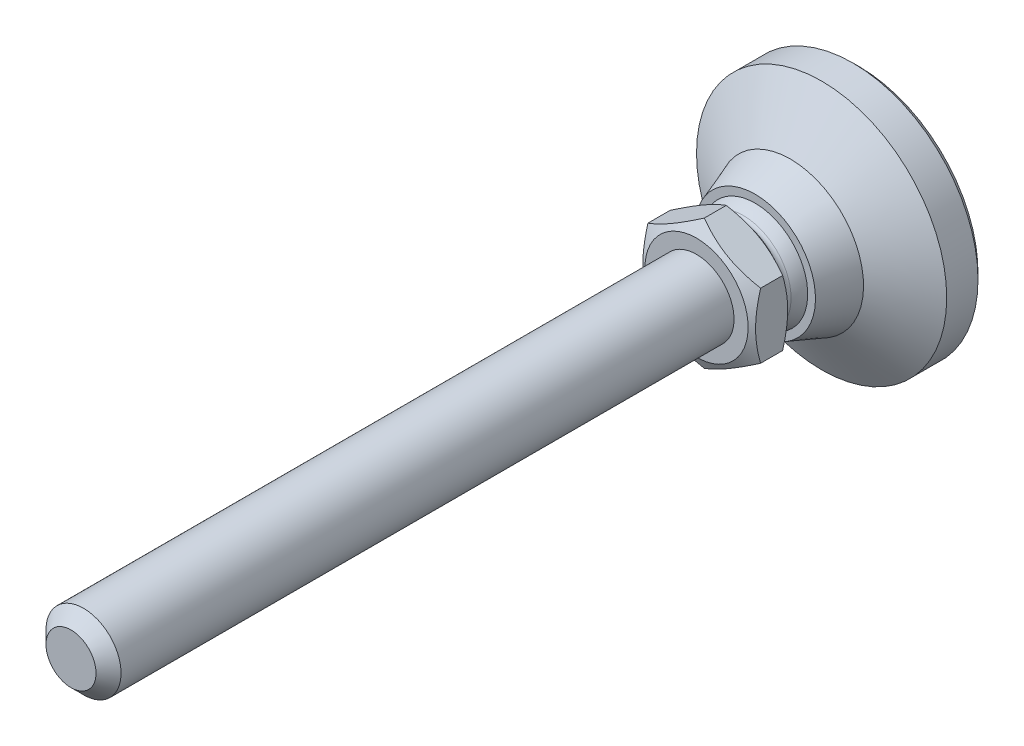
ISO-10303-21;
HEADER;
FILE_DESCRIPTION(('STEP AP214'),'2;1');
FILE_NAME('part.step','',(''),(''),'','','');
FILE_SCHEMA(('AUTOMOTIVE_DESIGN { 1 0 10303 214 1 1 1 1 }'));
ENDSEC;
DATA;
#1=APPLICATION_CONTEXT('core data for automotive mechanical design processes');
#2=APPLICATION_PROTOCOL_DEFINITION('international standard','automotive_design',2000,#1);
#3=PRODUCT_CONTEXT('',#1,'mechanical');
#4=PRODUCT('Part','Part','',(#3));
#5=PRODUCT_RELATED_PRODUCT_CATEGORY('part','',(#4));
#6=PRODUCT_DEFINITION_FORMATION('','',#4);
#7=PRODUCT_DEFINITION_CONTEXT('part definition',#1,'design');
#8=PRODUCT_DEFINITION('design','',#6,#7);
#9=PRODUCT_DEFINITION_SHAPE('','',#8);
#10=(LENGTH_UNIT() NAMED_UNIT(*) SI_UNIT(.MILLI.,.METRE.));
#11=(NAMED_UNIT(*) PLANE_ANGLE_UNIT() SI_UNIT($,.RADIAN.));
#12=(NAMED_UNIT(*) SI_UNIT($,.STERADIAN.) SOLID_ANGLE_UNIT());
#13=UNCERTAINTY_MEASURE_WITH_UNIT(LENGTH_MEASURE(1.E-05),#10,'distance_accuracy_value','');
#14=(GEOMETRIC_REPRESENTATION_CONTEXT(3) GLOBAL_UNCERTAINTY_ASSIGNED_CONTEXT((#13)) GLOBAL_UNIT_ASSIGNED_CONTEXT((#10,
#11,#12)) REPRESENTATION_CONTEXT('',''));
#15=CARTESIAN_POINT('',(0.,0.,0.));
#16=DIRECTION('',(0.,0.,1.));
#17=DIRECTION('',(1.,0.,0.));
#18=AXIS2_PLACEMENT_3D('',#15,#16,#17);
#19=CARTESIAN_POINT('',(0.,0.,19.0000000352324));
#20=DIRECTION('',(0.,0.,-1.));
#21=DIRECTION('',(0.,1.,0.));
#22=AXIS2_PLACEMENT_3D('',#19,#20,#21);
#23=TOROIDAL_SURFACE('',#22,8.5000000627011,1.);
#24=CARTESIAN_POINT('',(0.,0.,18.5101289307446));
#25=DIRECTION('',(0.,0.,-1.));
#26=DIRECTION('',(0.,1.,0.));
#27=AXIS2_PLACEMENT_3D('',#24,#25,#26);
#28=CIRCLE('',#27,7.62820518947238);
#29=CARTESIAN_POINT('',(-7.62820518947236,0.,18.5101289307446));
#30=VERTEX_POINT('',#29);
#31=EDGE_CURVE('E73',#30,#30,#28,.T.);
#32=ORIENTED_EDGE('',*,*,#31,.F.);
#33=EDGE_LOOP('',(#32));
#34=FACE_BOUND('',#33,.T.);
#35=CARTESIAN_POINT('',(0.,0.,20.0000000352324));
#36=DIRECTION('',(0.,0.,-1.));
#37=DIRECTION('',(0.,1.,0.));
#38=AXIS2_PLACEMENT_3D('',#35,#36,#37);
#39=CIRCLE('',#38,8.5000000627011);
#40=CARTESIAN_POINT('',(0.,8.5000000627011,20.0000000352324));
#41=VERTEX_POINT('',#40);
#42=EDGE_CURVE('E78',#41,#41,#39,.F.);
#43=ORIENTED_EDGE('',*,*,#42,.F.);
#44=EDGE_LOOP('',(#43));
#45=FACE_BOUND('',#44,.T.);
#46=ADVANCED_FACE('F14',(#34,#45),#23,.F.);
#47=CARTESIAN_POINT('',(0.,0.,14.223757));
#48=DIRECTION('',(0.,0.,-1.));
#49=DIRECTION('',(-1.,0.,0.));
#50=AXIS2_PLACEMENT_3D('',#47,#48,#49);
#51=SPHERICAL_SURFACE('',#50,8.74999992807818);
#52=CARTESIAN_POINT('',(0.,0.,16.635983));
#53=DIRECTION('',(0.,0.,-1.));
#54=DIRECTION('',(0.,1.,0.));
#55=AXIS2_PLACEMENT_3D('',#52,#53,#54);
#56=CIRCLE('',#55,8.41092530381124);
#57=CARTESIAN_POINT('',(-8.41092530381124,0.,16.635983));
#58=VERTEX_POINT('',#57);
#59=EDGE_CURVE('E109',#58,#58,#56,.T.);
#60=CARTESIAN_POINT('',(-8.41092530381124,0.,16.635983));
#61=CARTESIAN_POINT('',(-8.4050796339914,0.,16.6563656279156));
#62=CARTESIAN_POINT('',(-8.39915987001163,0.,16.6767270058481));
#63=CARTESIAN_POINT('',(-8.38717247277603,0.,16.7174061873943));
#64=CARTESIAN_POINT('',(-8.38110483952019,0.,16.7377239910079));
#65=CARTESIAN_POINT('',(-8.36882202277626,0.,16.7783149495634));
#66=CARTESIAN_POINT('',(-8.36260683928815,0.,16.7985881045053));
#67=CARTESIAN_POINT('',(-8.35002925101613,0.,16.8390886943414));
#68=CARTESIAN_POINT('',(-8.34366684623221,0.,16.8593161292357));
#69=CARTESIAN_POINT('',(-8.33079515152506,0.,16.8997242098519));
#70=CARTESIAN_POINT('',(-8.32428586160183,0.,16.9199048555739));
#71=CARTESIAN_POINT('',(-8.31112074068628,0.,16.9602182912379));
#72=CARTESIAN_POINT('',(-8.30446490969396,0.,16.98035108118));
#73=CARTESIAN_POINT('',(-8.29100705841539,0.,17.0205677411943));
#74=CARTESIAN_POINT('',(-8.28420503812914,0.,17.0406516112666));
#75=CARTESIAN_POINT('',(-8.27045516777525,0.,17.08076937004));
#76=CARTESIAN_POINT('',(-8.26350731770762,0.,17.1008032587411));
#77=CARTESIAN_POINT('',(-8.24946615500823,0.,17.1408199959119));
#78=CARTESIAN_POINT('',(-8.24237284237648,0.,17.1608028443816));
#79=CARTESIAN_POINT('',(-8.22804112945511,0.,17.2007164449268));
#80=CARTESIAN_POINT('',(-8.22080272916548,0.,17.2206471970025));
#81=CARTESIAN_POINT('',(-8.20618122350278,0.,17.2604555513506));
#82=CARTESIAN_POINT('',(-8.1987981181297,0.,17.2803331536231));
#83=CARTESIAN_POINT('',(-8.18388759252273,0.,17.3200341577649));
#84=CARTESIAN_POINT('',(-8.17636017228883,0.,17.3398575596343));
#85=CARTESIAN_POINT('',(-8.16116141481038,0.,17.3794491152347));
#86=CARTESIAN_POINT('',(-8.15349007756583,0.,17.3992172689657));
#87=CARTESIAN_POINT('',(-8.13800389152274,0.,17.4386972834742));
#88=CARTESIAN_POINT('',(-8.13018904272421,0.,17.4584091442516));
#89=CARTESIAN_POINT('',(-8.11441624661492,0.,17.4977755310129));
#90=CARTESIAN_POINT('',(-8.10645829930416,0.,17.5174300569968));
#91=CARTESIAN_POINT('',(-8.09039972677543,0.,17.5566807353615));
#92=CARTESIAN_POINT('',(-8.08229910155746,0.,17.5762768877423));
#93=CARTESIAN_POINT('',(-8.06595560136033,0.,17.6154097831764));
#94=CARTESIAN_POINT('',(-8.05771272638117,0.,17.6349465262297));
#95=CARTESIAN_POINT('',(-8.04108516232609,0.,17.6739595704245));
#96=CARTESIAN_POINT('',(-8.03270047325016,0.,17.6934358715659));
#97=CARTESIAN_POINT('',(-8.01578972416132,0.,17.7323270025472));
#98=CARTESIAN_POINT('',(-8.00726366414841,0.,17.751741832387));
#99=CARTESIAN_POINT('',(-7.99007062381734,0.,17.7905089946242));
#100=CARTESIAN_POINT('',(-7.98140364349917,0.,17.8098613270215));
#101=CARTESIAN_POINT('',(-7.96392922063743,0.,17.8485024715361));
#102=CARTESIAN_POINT('',(-7.95512177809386,0.,17.8677912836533));
#103=CARTESIAN_POINT('',(-7.93736689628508,0.,17.9063043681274));
#104=CARTESIAN_POINT('',(-7.92841945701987,0.,17.9255286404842));
#105=CARTESIAN_POINT('',(-7.91038505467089,0.,17.9639116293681));
#106=CARTESIAN_POINT('',(-7.90129809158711,0.,17.9830703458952));
#107=CARTESIAN_POINT('',(-7.88298512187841,0.,18.0213212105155));
#108=CARTESIAN_POINT('',(-7.87375911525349,0.,18.0404133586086));
#109=CARTESIAN_POINT('',(-7.85516854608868,0.,18.0785300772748));
#110=CARTESIAN_POINT('',(-7.8458039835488,0.,18.0975546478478));
#111=CARTESIAN_POINT('',(-7.8269367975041,0.,18.1355352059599));
#112=CARTESIAN_POINT('',(-7.81743417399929,0.,18.1544911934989));
#113=CARTESIAN_POINT('',(-7.79829136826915,0.,18.1923335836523));
#114=CARTESIAN_POINT('',(-7.78865118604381,0.,18.2112199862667));
#115=CARTESIAN_POINT('',(-7.76923377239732,0.,18.2489222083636));
#116=CARTESIAN_POINT('',(-7.75945654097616,0.,18.267738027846));
#117=CARTESIAN_POINT('',(-7.73976554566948,0.,18.3052980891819));
#118=CARTESIAN_POINT('',(-7.72985178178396,0.,18.3240423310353));
#119=CARTESIAN_POINT('',(-7.70988824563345,0.,18.3614582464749));
#120=CARTESIAN_POINT('',(-7.69983847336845,0.,18.3801299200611));
#121=CARTESIAN_POINT('',(-7.67960345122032,0.,18.4173997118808));
#122=CARTESIAN_POINT('',(-7.66941820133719,0.,18.4359978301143));
#123=CARTESIAN_POINT('',(-7.64891276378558,0.,18.4731195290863));
#124=CARTESIAN_POINT('',(-7.63859257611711,0.,18.4916431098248));
#125=CARTESIAN_POINT('',(-7.62820518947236,0.,18.5101289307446));
#126=B_SPLINE_CURVE_WITH_KNOTS('',3,(#60,#61,#62,#63,#64,#65,#66,#67,#68,#69,#70,#71,#72,#73,
#74,#75,#76,#77,#78,#79,#80,#81,#82,#83,#84,#85,#86,#87,#88,#89,#90,#91,#92,#93,#94,#95,#96,#97,
#98,#99,#100,#101,#102,#103,#104,#105,#106,#107,#108,#109,#110,#111,#112,#113,#114,#115,#116,
#117,#118,#119,#120,#121,#122,#123,#124,#125),.UNSPECIFIED.,.F.,.F.,(4,2,2,2,2,2,2,2,2,2,2,2,2,
2,2,2,2,2,2,2,2,2,2,2,2,2,2,2,2,2,2,2,4),(0.,0.0636128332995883,0.127225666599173,
0.19083849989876,0.254451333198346,0.318064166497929,0.381676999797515,0.445289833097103,
0.508902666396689,0.572515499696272,0.63612833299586,0.699741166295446,0.763353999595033,
0.826966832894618,0.890579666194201,0.954192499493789,1.01780533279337,1.08141816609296,
1.14503099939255,1.20864383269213,1.27225666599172,1.3358694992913,1.39948233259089,
1.46309516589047,1.52670799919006,1.59032083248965,1.65393366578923,1.71754649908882,
1.78115933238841,1.84477216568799,1.90838499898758,1.97199783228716,2.03561066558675),.UNSPECIFIED.);
#127=EDGE_CURVE('BSEAM224',#58,#30,#126,.T.);
#128=ORIENTED_EDGE('',*,*,#59,.F.);
#129=ORIENTED_EDGE('',*,*,#31,.T.);
#130=ORIENTED_EDGE('',*,*,#127,.T.);
#131=ORIENTED_EDGE('',*,*,#127,.F.);
#132=EDGE_LOOP('',(#128,#130,#129,#131));
#133=FACE_BOUND('',#132,.T.);
#134=ADVANCED_FACE('F224',(#133),#51,.T.);
#135=CARTESIAN_POINT('',(-8.41092530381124,0.,16.635983));
#136=DIRECTION('',(0.,0.,-1.));
#137=DIRECTION('',(0.,1.,0.));
#138=AXIS2_PLACEMENT_3D('',#135,#136,#137);
#139=PLANE('',#138);
#140=CARTESIAN_POINT('',(0.,0.,16.635983));
#141=DIRECTION('',(0.,0.,-1.));
#142=DIRECTION('',(0.,1.,0.));
#143=AXIS2_PLACEMENT_3D('',#140,#141,#142);
#144=CIRCLE('',#143,9.649999);
#145=CARTESIAN_POINT('',(0.,9.649999,16.635983));
#146=VERTEX_POINT('',#145);
#147=EDGE_CURVE('E106',#146,#146,#144,.T.);
#148=ORIENTED_EDGE('',*,*,#147,.F.);
#149=EDGE_LOOP('',(#148));
#150=FACE_BOUND('',#149,.T.);
#151=ORIENTED_EDGE('',*,*,#59,.T.);
#152=EDGE_LOOP('',(#151));
#153=FACE_BOUND('',#152,.T.);
#154=ADVANCED_FACE('F220',(#150,#153),#139,.F.);
#155=CARTESIAN_POINT('',(0.,0.,16.635983));
#156=DIRECTION('',(0.,0.,-1.));
#157=DIRECTION('',(0.,1.,0.));
#158=AXIS2_PLACEMENT_3D('',#155,#156,#157);
#159=CONICAL_SURFACE('',#158,9.649999,0.349065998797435);
#160=CARTESIAN_POINT('',(0.,0.,11.));
#161=DIRECTION('',(0.,0.,-1.));
#162=DIRECTION('',(0.,1.,0.));
#163=AXIS2_PLACEMENT_3D('',#160,#161,#162);
#164=CIRCLE('',#163,11.70133);
#165=CARTESIAN_POINT('',(0.,11.70133,11.));
#166=VERTEX_POINT('',#165);
#167=EDGE_CURVE('E103',#166,#166,#164,.T.);
#168=ORIENTED_EDGE('',*,*,#167,.F.);
#169=EDGE_LOOP('',(#168));
#170=FACE_BOUND('',#169,.T.);
#171=ORIENTED_EDGE('',*,*,#147,.T.);
#172=EDGE_LOOP('',(#171));
#173=FACE_BOUND('',#172,.T.);
#174=ADVANCED_FACE('F216',(#170,#173),#159,.T.);
#175=CARTESIAN_POINT('',(0.,0.,11.));
#176=DIRECTION('',(0.,0.,-1.));
#177=DIRECTION('',(0.,1.,0.));
#178=AXIS2_PLACEMENT_3D('',#175,#176,#177);
#179=CONICAL_SURFACE('',#178,11.70133,1.02853608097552);
#180=CARTESIAN_POINT('',(0.,0.,6.));
#181=DIRECTION('',(0.,0.,-1.));
#182=DIRECTION('',(0.,1.,0.));
#183=AXIS2_PLACEMENT_3D('',#180,#181,#182);
#184=CIRCLE('',#183,20.);
#185=CARTESIAN_POINT('',(0.,20.,6.));
#186=VERTEX_POINT('',#185);
#187=EDGE_CURVE('E100',#186,#186,#184,.T.);
#188=ORIENTED_EDGE('',*,*,#187,.F.);
#189=EDGE_LOOP('',(#188));
#190=FACE_BOUND('',#189,.T.);
#191=ORIENTED_EDGE('',*,*,#167,.T.);
#192=EDGE_LOOP('',(#191));
#193=FACE_BOUND('',#192,.T.);
#194=ADVANCED_FACE('F212',(#190,#193),#179,.T.);
#195=CARTESIAN_POINT('',(0.,0.,0.));
#196=DIRECTION('',(0.,0.,-1.));
#197=DIRECTION('',(0.,1.,0.));
#198=AXIS2_PLACEMENT_3D('',#195,#196,#197);
#199=CYLINDRICAL_SURFACE('',#198,20.);
#200=CARTESIAN_POINT('',(0.,0.,1.));
#201=DIRECTION('',(0.,0.,-1.));
#202=DIRECTION('',(0.,1.,0.));
#203=AXIS2_PLACEMENT_3D('',#200,#201,#202);
#204=CIRCLE('',#203,20.);
#205=CARTESIAN_POINT('',(0.,20.,1.));
#206=VERTEX_POINT('',#205);
#207=EDGE_CURVE('E97',#206,#206,#204,.T.);
#208=ORIENTED_EDGE('',*,*,#207,.F.);
#209=EDGE_LOOP('',(#208));
#210=FACE_BOUND('',#209,.T.);
#211=ORIENTED_EDGE('',*,*,#187,.T.);
#212=EDGE_LOOP('',(#211));
#213=FACE_BOUND('',#212,.T.);
#214=ADVANCED_FACE('F208',(#210,#213),#199,.T.);
#215=CARTESIAN_POINT('',(0.,0.,1.));
#216=DIRECTION('',(0.,0.,1.));
#217=DIRECTION('',(0.,-1.,0.));
#218=AXIS2_PLACEMENT_3D('',#215,#216,#217);
#219=CONICAL_SURFACE('',#218,20.,0.785398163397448);
#220=CARTESIAN_POINT('',(0.,0.,0.));
#221=DIRECTION('',(0.,0.,-1.));
#222=DIRECTION('',(0.,1.,0.));
#223=AXIS2_PLACEMENT_3D('',#220,#221,#222);
#224=CIRCLE('',#223,19.);
#225=CARTESIAN_POINT('',(0.,19.,0.));
#226=VERTEX_POINT('',#225);
#227=EDGE_CURVE('E94',#226,#226,#224,.T.);
#228=ORIENTED_EDGE('',*,*,#227,.F.);
#229=EDGE_LOOP('',(#228));
#230=FACE_BOUND('',#229,.T.);
#231=ORIENTED_EDGE('',*,*,#207,.T.);
#232=EDGE_LOOP('',(#231));
#233=FACE_BOUND('',#232,.T.);
#234=ADVANCED_FACE('F204',(#230,#233),#219,.T.);
#235=CARTESIAN_POINT('',(0.,0.,0.));
#236=DIRECTION('',(0.,0.,1.));
#237=DIRECTION('',(0.,-1.,0.));
#238=AXIS2_PLACEMENT_3D('',#235,#236,#237);
#239=PLANE('',#238);
#240=ORIENTED_EDGE('',*,*,#227,.T.);
#241=EDGE_LOOP('',(#240));
#242=FACE_BOUND('',#241,.T.);
#243=ADVANCED_FACE('F200',(#242),#239,.F.);
#244=CARTESIAN_POINT('',(0.,8.25,20.0000000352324));
#245=DIRECTION('',(0.,0.,-1.));
#246=DIRECTION('',(0.,1.,0.));
#247=AXIS2_PLACEMENT_3D('',#244,#245,#246);
#248=PLANE('',#247);
#249=ORIENTED_EDGE('',*,*,#42,.T.);
#250=EDGE_LOOP('',(#249));
#251=FACE_BOUND('',#250,.T.);
#252=CARTESIAN_POINT('',(0.,0.,20.0000000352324));
#253=DIRECTION('',(0.,0.,-1.));
#254=DIRECTION('',(0.,1.,0.));
#255=AXIS2_PLACEMENT_3D('',#252,#253,#254);
#256=CIRCLE('',#255,8.25);
#257=CARTESIAN_POINT('',(0.,8.25,20.0000000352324));
#258=VERTEX_POINT('',#257);
#259=EDGE_CURVE('E292',#258,#258,#256,.T.);
#260=ORIENTED_EDGE('',*,*,#259,.T.);
#261=EDGE_LOOP('',(#260));
#262=FACE_BOUND('',#261,.T.);
#263=ADVANCED_FACE('F129',(#251,#262),#248,.F.);
#264=CARTESIAN_POINT('',(0.,0.,22.0431578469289));
#265=DIRECTION('',(0.,0.,1.));
#266=DIRECTION('',(0.,-1.,0.));
#267=AXIS2_PLACEMENT_3D('',#264,#265,#266);
#268=CONICAL_SURFACE('',#267,11.7888531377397,1.0471975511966);
#269=CARTESIAN_POINT('',(0.000200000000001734,-10.4000990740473,21.2413603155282));
#270=CARTESIAN_POINT('',(-0.19775320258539,-10.2858107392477,21.1753793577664));
#271=CARTESIAN_POINT('',(-0.396478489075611,-10.1710766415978,21.1123922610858));
#272=CARTESIAN_POINT('',(-0.795542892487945,-9.94067670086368,20.9932318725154));
#273=CARTESIAN_POINT('',(-0.995882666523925,-9.82501047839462,20.9370615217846));
#274=CARTESIAN_POINT('',(-1.39854780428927,-9.59253165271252,20.8322960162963));
#275=CARTESIAN_POINT('',(-1.60087672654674,-9.47571699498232,20.7837189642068));
#276=CARTESIAN_POINT('',(-2.00691067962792,-9.24129318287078,20.6951913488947));
#277=CARTESIAN_POINT('',(-2.21061542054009,-9.12368419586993,20.655239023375));
#278=CARTESIAN_POINT('',(-2.61423624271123,-8.89065360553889,20.5856466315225));
#279=CARTESIAN_POINT('',(-2.81412251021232,-8.77524921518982,20.5557774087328));
#280=CARTESIAN_POINT('',(-3.21478942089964,-8.54392406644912,20.5056962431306));
#281=CARTESIAN_POINT('',(-3.41556998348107,-8.42800335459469,20.4854834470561));
#282=CARTESIAN_POINT('',(-3.81747936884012,-8.19596086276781,20.4552200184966));
#283=CARTESIAN_POINT('',(-4.01860753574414,-8.07983946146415,20.4451578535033));
#284=CARTESIAN_POINT('',(-4.4210489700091,-7.84748979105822,20.4354133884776));
#285=CARTESIAN_POINT('',(-4.62236223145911,-7.73126152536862,20.4357307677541));
#286=CARTESIAN_POINT('',(-4.99872349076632,-7.51396925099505,20.4460228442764));
#287=CARTESIAN_POINT('',(-5.17379802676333,-7.41288992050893,20.4547420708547));
#288=CARTESIAN_POINT('',(-5.52353701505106,-7.2109680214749,20.4798612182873));
#289=CARTESIAN_POINT('',(-5.69820143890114,-7.1101254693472,20.4962616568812));
#290=CARTESIAN_POINT('',(-6.2215185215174,-6.80798821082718,20.5565970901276));
#291=CARTESIAN_POINT('',(-6.56924487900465,-6.60722830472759,20.6116586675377));
#292=CARTESIAN_POINT('',(-7.26838615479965,-6.20357890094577,20.7493132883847));
#293=CARTESIAN_POINT('',(-7.61971184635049,-6.00074091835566,20.8324898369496));
#294=CARTESIAN_POINT('',(-8.31712409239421,-5.59808977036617,21.0212661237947));
#295=CARTESIAN_POINT('',(-8.66321957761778,-5.39827144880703,21.1268215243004));
#296=CARTESIAN_POINT('',(-9.00685,-5.19987633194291,21.2413603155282));
#297=B_SPLINE_CURVE_WITH_KNOTS('',3,(#269,#270,#271,#272,#273,#274,#275,#276,#277,#278,#279,
#280,#281,#282,#283,#284,#285,#286,#287,#288,#289,#290,#291,#292,#293,#294,#295,#296),
.UNSPECIFIED.,.F.,.F.,(4,2,2,2,2,2,2,2,2,2,2,2,2,4),(0.,0.713746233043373,1.42779933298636,
2.14352961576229,2.85911351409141,3.55712384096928,4.25507247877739,4.95222725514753,
5.64936049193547,6.25624894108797,6.86317830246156,8.07790154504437,9.31956468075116,
10.5587904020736),.UNSPECIFIED.);
#298=CARTESIAN_POINT('',(0.,-10.3999836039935,21.2412936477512));
#299=VERTEX_POINT('',#298);
#300=CARTESIAN_POINT('',(-9.00665,-5.19999180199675,21.2412936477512));
#301=VERTEX_POINT('',#300);
#302=EDGE_CURVE('E69',#299,#301,#297,.T.);
#303=ORIENTED_EDGE('',*,*,#302,.T.);
#304=CARTESIAN_POINT('',(-9.00665,13.8418368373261,24.7712924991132));
#305=CARTESIAN_POINT('',(-9.00665,13.645666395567,24.676362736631));
#306=CARTESIAN_POINT('',(-9.00665,13.449262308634,24.581916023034));
#307=CARTESIAN_POINT('',(-9.00665,13.0559380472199,24.3940983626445));
#308=CARTESIAN_POINT('',(-9.00665,12.8590178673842,24.3007274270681));
#309=CARTESIAN_POINT('',(-9.00665,12.2673557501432,24.0223673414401));
#310=CARTESIAN_POINT('',(-9.00665,11.8717722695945,23.8391600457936));
#311=CARTESIAN_POINT('',(-9.00665,11.075701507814,23.4776158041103));
#312=CARTESIAN_POINT('',(-9.00665,10.6751991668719,23.2993119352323));
#313=CARTESIAN_POINT('',(-9.00665,9.87096507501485,22.9501690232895));
#314=CARTESIAN_POINT('',(-9.00665,9.46723348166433,22.7793296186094));
#315=CARTESIAN_POINT('',(-9.00665,8.64339130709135,22.4419741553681));
#316=CARTESIAN_POINT('',(-9.00665,8.22315919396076,22.2757532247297));
#317=CARTESIAN_POINT('',(-9.00665,7.37773338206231,21.9561991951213));
#318=CARTESIAN_POINT('',(-9.00665,6.95253912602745,21.8028675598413));
#319=CARTESIAN_POINT('',(-9.00665,6.09734470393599,21.5132106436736));
#320=CARTESIAN_POINT('',(-9.00665,5.66735670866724,21.3768498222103));
#321=CARTESIAN_POINT('',(-9.00665,4.80123080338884,21.1255906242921));
#322=CARTESIAN_POINT('',(-9.00665,4.36509491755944,21.0106853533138));
#323=CARTESIAN_POINT('',(-9.00665,3.4887324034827,20.8085420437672));
#324=CARTESIAN_POINT('',(-9.00665,3.04853998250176,20.7211597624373));
#325=CARTESIAN_POINT('',(-9.00665,2.38434575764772,20.614577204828));
#326=CARTESIAN_POINT('',(-9.00665,2.16227951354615,20.5831300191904));
#327=CARTESIAN_POINT('',(-9.00665,1.71708662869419,20.5290187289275));
#328=CARTESIAN_POINT('',(-9.00665,1.49396009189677,20.5063537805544));
#329=CARTESIAN_POINT('',(-9.00665,1.04980509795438,20.4705363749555));
#330=CARTESIAN_POINT('',(-9.00665,0.828786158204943,20.4572663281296));
#331=CARTESIAN_POINT('',(-9.00665,0.386385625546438,20.4400752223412));
#332=CARTESIAN_POINT('',(-9.00665,0.165004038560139,20.436154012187));
#333=CARTESIAN_POINT('',(-9.00665,-0.277728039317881,20.4377538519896));
#334=CARTESIAN_POINT('',(-9.00665,-0.499078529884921,20.4432749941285));
#335=CARTESIAN_POINT('',(-9.00665,-0.941354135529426,20.463627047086));
#336=CARTESIAN_POINT('',(-9.00665,-1.16227922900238,20.4784584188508));
#337=CARTESIAN_POINT('',(-9.00665,-1.69708677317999,20.5253211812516));
#338=CARTESIAN_POINT('',(-9.00665,-2.01057025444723,20.5619837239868));
#339=CARTESIAN_POINT('',(-9.00665,-2.63512878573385,20.6520270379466));
#340=CARTESIAN_POINT('',(-9.00665,-2.94620348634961,20.7054101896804));
#341=CARTESIAN_POINT('',(-9.00665,-3.56567550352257,20.8269954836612));
#342=CARTESIAN_POINT('',(-9.00665,-3.87407046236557,20.8952095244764));
#343=CARTESIAN_POINT('',(-9.00665,-4.48772745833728,21.0443828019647));
#344=CARTESIAN_POINT('',(-9.00665,-4.79298955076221,21.1253418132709));
#345=CARTESIAN_POINT('',(-9.00665,-5.40705625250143,21.2999460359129));
#346=CARTESIAN_POINT('',(-9.00665,-5.71579258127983,21.3938297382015));
#347=CARTESIAN_POINT('',(-9.00665,-6.33022259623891,21.5910253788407));
#348=CARTESIAN_POINT('',(-9.00665,-6.63591626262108,21.6943373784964));
#349=CARTESIAN_POINT('',(-9.00665,-7.24441712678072,21.9087730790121));
#350=CARTESIAN_POINT('',(-9.00665,-7.54722530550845,22.0198940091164));
#351=CARTESIAN_POINT('',(-9.00665,-8.15035041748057,22.2486669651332));
#352=CARTESIAN_POINT('',(-9.00665,-8.4506673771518,22.3663189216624));
#353=CARTESIAN_POINT('',(-9.00665,-9.14814564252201,22.6469122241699));
#354=CARTESIAN_POINT('',(-9.00665,-9.544460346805,22.8119545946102));
#355=CARTESIAN_POINT('',(-9.00665,-10.3338341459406,23.1496706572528));
#356=CARTESIAN_POINT('',(-9.00665,-10.7268930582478,23.3223447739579));
#357=CARTESIAN_POINT('',(-9.00665,-11.5103487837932,23.6738242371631));
#358=CARTESIAN_POINT('',(-9.00665,-11.9007450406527,23.8526308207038));
#359=CARTESIAN_POINT('',(-9.00665,-12.6792321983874,24.2151632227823));
#360=CARTESIAN_POINT('',(-9.00665,-13.0673231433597,24.3988889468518));
#361=CARTESIAN_POINT('',(-9.00665,-13.8419692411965,24.7705441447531));
#362=CARTESIAN_POINT('',(-9.00665,-14.2285224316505,24.9584777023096));
#363=CARTESIAN_POINT('',(-9.00665,-14.9999978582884,25.3376660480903));
#364=CARTESIAN_POINT('',(-9.00665,-15.3849200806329,25.5289208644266));
#365=CARTESIAN_POINT('',(-9.00665,-16.5375296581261,26.1067529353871));
#366=CARTESIAN_POINT('',(-9.00665,-17.3031546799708,26.4974436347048));
#367=CARTESIAN_POINT('',(-9.00665,-18.7683412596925,27.2545281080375));
#368=CARTESIAN_POINT('',(-9.00665,-19.4682166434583,27.6203171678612));
#369=CARTESIAN_POINT('',(-9.00665,-20.8653801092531,28.3568542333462));
#370=CARTESIAN_POINT('',(-9.00665,-21.5626681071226,28.7276023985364));
#371=CARTESIAN_POINT('',(-9.00665,-22.9535940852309,29.4720181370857));
#372=CARTESIAN_POINT('',(-9.00665,-23.6472367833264,29.8456769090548));
#373=CARTESIAN_POINT('',(-9.00665,-25.0328619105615,30.5959765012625));
#374=CARTESIAN_POINT('',(-9.00665,-25.7248444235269,30.9726171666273));
#375=CARTESIAN_POINT('',(-9.00665,-26.4162126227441,31.3503746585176));
#376=B_SPLINE_CURVE_WITH_KNOTS('',3,(#304,#305,#306,#307,#308,#309,#310,#311,#312,#313,#314,
#315,#316,#317,#318,#319,#320,#321,#322,#323,#324,#325,#326,#327,#328,#329,#330,#331,#332,#333,
#334,#335,#336,#337,#338,#339,#340,#341,#342,#343,#344,#345,#346,#347,#348,#349,#350,#351,#352,
#353,#354,#355,#356,#357,#358,#359,#360,#361,#362,#363,#364,#365,#366,#367,#368,#369,#370,#371,
#372,#373,#374,#375),.UNSPECIFIED.,.F.,.F.,(4,2,2,2,2,2,2,2,2,2,2,2,2,2,2,2,2,2,2,2,2,2,2,2,2,2,
2,2,2,2,2,2,2,2,2,4),(0.,0.653795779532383,1.30759836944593,2.61540372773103,3.93054371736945,
5.24561992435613,6.60119195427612,7.9569177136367,9.30975472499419,10.6621562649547,
12.0073474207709,12.6800465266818,13.3526809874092,14.0167401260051,14.6807885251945,
15.3448434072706,16.0089311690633,16.955264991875,17.9017336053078,18.848964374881,
19.7961783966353,20.7640837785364,21.7319954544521,22.6995654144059,23.6671250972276,
24.9549380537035,26.2428227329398,27.5309687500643,28.8190900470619,30.1085208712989,
31.3979626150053,33.9765303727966,36.3456111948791,38.7147684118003,41.0784124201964,
43.4419344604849),.UNSPECIFIED.);
#377=CARTESIAN_POINT('',(-9.00665,5.19999180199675,21.2412936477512));
#378=VERTEX_POINT('',#377);
#379=EDGE_CURVE('E79',#301,#378,#376,.F.);
#380=ORIENTED_EDGE('',*,*,#379,.T.);
#381=CARTESIAN_POINT('',(-9.00685,5.19987633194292,21.2413603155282));
#382=CARTESIAN_POINT('',(-8.80889679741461,5.31416466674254,21.1753793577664));
#383=CARTESIAN_POINT('',(-8.61017151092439,5.42889876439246,21.1123922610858));
#384=CARTESIAN_POINT('',(-8.21110710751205,5.65929870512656,20.9932318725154));
#385=CARTESIAN_POINT('',(-8.01076733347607,5.77496492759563,20.9370615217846));
#386=CARTESIAN_POINT('',(-7.60810219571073,6.00744375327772,20.8322960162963));
#387=CARTESIAN_POINT('',(-7.40577327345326,6.12425841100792,20.7837189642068));
#388=CARTESIAN_POINT('',(-6.99973932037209,6.35868222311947,20.6951913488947));
#389=CARTESIAN_POINT('',(-6.79603457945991,6.47629121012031,20.655239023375));
#390=CARTESIAN_POINT('',(-6.39241375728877,6.70932180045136,20.5856466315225));
#391=CARTESIAN_POINT('',(-6.19252748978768,6.82472619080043,20.5557774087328));
#392=CARTESIAN_POINT('',(-5.79186057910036,7.05605133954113,20.5056962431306));
#393=CARTESIAN_POINT('',(-5.59108001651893,7.17197205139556,20.4854834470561));
#394=CARTESIAN_POINT('',(-5.18917063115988,7.40401454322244,20.4552200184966));
#395=CARTESIAN_POINT('',(-4.98804246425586,7.52013594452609,20.4451578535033));
#396=CARTESIAN_POINT('',(-4.5856010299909,7.75248561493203,20.4354133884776));
#397=CARTESIAN_POINT('',(-4.38428776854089,7.86871388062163,20.4357307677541));
#398=CARTESIAN_POINT('',(-4.00792650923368,8.0860061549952,20.4460228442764));
#399=CARTESIAN_POINT('',(-3.83285197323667,8.18708548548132,20.4547420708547));
#400=CARTESIAN_POINT('',(-3.48311298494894,8.38900738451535,20.4798612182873));
#401=CARTESIAN_POINT('',(-3.30844856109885,8.48984993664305,20.4962616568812));
#402=CARTESIAN_POINT('',(-2.7851314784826,8.79198719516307,20.5565970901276));
#403=CARTESIAN_POINT('',(-2.43740512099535,8.99274710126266,20.6116586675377));
#404=CARTESIAN_POINT('',(-1.73826384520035,9.39639650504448,20.7493132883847));
#405=CARTESIAN_POINT('',(-1.38693815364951,9.59923448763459,20.8324898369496));
#406=CARTESIAN_POINT('',(-0.689525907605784,10.0018856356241,21.0212661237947));
#407=CARTESIAN_POINT('',(-0.34343042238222,10.2017039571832,21.1268215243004));
#408=CARTESIAN_POINT('',(0.000200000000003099,10.4000990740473,21.2413603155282));
#409=B_SPLINE_CURVE_WITH_KNOTS('',3,(#381,#382,#383,#384,#385,#386,#387,#388,#389,#390,#391,
#392,#393,#394,#395,#396,#397,#398,#399,#400,#401,#402,#403,#404,#405,#406,#407,#408),
.UNSPECIFIED.,.F.,.F.,(4,2,2,2,2,2,2,2,2,2,2,2,2,4),(0.,0.713746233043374,1.42779933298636,
2.14352961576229,2.85911351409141,3.55712384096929,4.25507247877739,4.95222725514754,
5.64936049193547,6.25624894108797,6.86317830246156,8.07790154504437,9.31956468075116,
10.5587904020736),.UNSPECIFIED.);
#410=CARTESIAN_POINT('',(0.,10.3999836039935,21.2412936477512));
#411=VERTEX_POINT('',#410);
#412=EDGE_CURVE('E152',#378,#411,#409,.T.);
#413=ORIENTED_EDGE('',*,*,#412,.T.);
#414=CARTESIAN_POINT('',(-0.000199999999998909,10.4000990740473,21.2413603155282));
#415=CARTESIAN_POINT('',(0.19775320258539,10.2858107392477,21.1753793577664));
#416=CARTESIAN_POINT('',(0.396478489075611,10.1710766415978,21.1123922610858));
#417=CARTESIAN_POINT('',(0.795542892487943,9.94067670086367,20.9932318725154));
#418=CARTESIAN_POINT('',(0.995882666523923,9.82501047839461,20.9370615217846));
#419=CARTESIAN_POINT('',(1.39854780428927,9.59253165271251,20.8322960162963));
#420=CARTESIAN_POINT('',(1.60087672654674,9.47571699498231,20.7837189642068));
#421=CARTESIAN_POINT('',(2.00691067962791,9.24129318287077,20.6951913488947));
#422=CARTESIAN_POINT('',(2.21061542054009,9.12368419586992,20.655239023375));
#423=CARTESIAN_POINT('',(2.61423624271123,8.89065360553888,20.5856466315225));
#424=CARTESIAN_POINT('',(2.81412251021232,8.77524921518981,20.5557774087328));
#425=CARTESIAN_POINT('',(3.21478942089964,8.54392406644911,20.5056962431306));
#426=CARTESIAN_POINT('',(3.41556998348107,8.42800335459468,20.485483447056));
#427=CARTESIAN_POINT('',(3.81747936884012,8.1959608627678,20.4552200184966));
#428=CARTESIAN_POINT('',(4.01860753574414,8.07983946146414,20.4451578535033));
#429=CARTESIAN_POINT('',(4.4210489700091,7.84748979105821,20.4354133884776));
#430=CARTESIAN_POINT('',(4.62236223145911,7.73126152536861,20.4357307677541));
#431=CARTESIAN_POINT('',(4.99872349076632,7.51396925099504,20.4460228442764));
#432=CARTESIAN_POINT('',(5.17379802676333,7.41288992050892,20.4547420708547));
#433=CARTESIAN_POINT('',(5.52353701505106,7.21096802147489,20.4798612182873));
#434=CARTESIAN_POINT('',(5.69820143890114,7.11012546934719,20.4962616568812));
#435=CARTESIAN_POINT('',(6.2215185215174,6.80798821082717,20.5565970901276));
#436=CARTESIAN_POINT('',(6.56924487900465,6.60722830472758,20.6116586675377));
#437=CARTESIAN_POINT('',(7.26838615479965,6.20357890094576,20.7493132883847));
#438=CARTESIAN_POINT('',(7.61971184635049,6.00074091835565,20.8324898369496));
#439=CARTESIAN_POINT('',(8.31712409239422,5.59808977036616,21.0212661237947));
#440=CARTESIAN_POINT('',(8.66321957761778,5.39827144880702,21.1268215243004));
#441=CARTESIAN_POINT('',(9.00685,5.1998763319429,21.2413603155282));
#442=B_SPLINE_CURVE_WITH_KNOTS('',3,(#414,#415,#416,#417,#418,#419,#420,#421,#422,#423,#424,
#425,#426,#427,#428,#429,#430,#431,#432,#433,#434,#435,#436,#437,#438,#439,#440,#441),
.UNSPECIFIED.,.F.,.F.,(4,2,2,2,2,2,2,2,2,2,2,2,2,4),(0.,0.713746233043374,1.42779933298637,
2.14352961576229,2.85911351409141,3.55712384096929,4.25507247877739,4.95222725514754,
5.64936049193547,6.25624894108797,6.86317830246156,8.07790154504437,9.31956468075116,
10.5587904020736),.UNSPECIFIED.);
#443=CARTESIAN_POINT('',(9.00665,5.19999180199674,21.2412936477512));
#444=VERTEX_POINT('',#443);
#445=EDGE_CURVE('E145',#411,#444,#442,.T.);
#446=ORIENTED_EDGE('',*,*,#445,.T.);
#447=CARTESIAN_POINT('',(9.00665,13.8418368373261,24.7712924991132));
#448=CARTESIAN_POINT('',(9.00665,13.645666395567,24.676362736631));
#449=CARTESIAN_POINT('',(9.00665,13.449262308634,24.581916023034));
#450=CARTESIAN_POINT('',(9.00665,13.0559380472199,24.3940983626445));
#451=CARTESIAN_POINT('',(9.00665,12.8590178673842,24.3007274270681));
#452=CARTESIAN_POINT('',(9.00665,12.2673557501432,24.0223673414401));
#453=CARTESIAN_POINT('',(9.00665,11.8717722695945,23.8391600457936));
#454=CARTESIAN_POINT('',(9.00665,11.075701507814,23.4776158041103));
#455=CARTESIAN_POINT('',(9.00665,10.6751991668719,23.2993119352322));
#456=CARTESIAN_POINT('',(9.00665,9.87096507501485,22.9501690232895));
#457=CARTESIAN_POINT('',(9.00665,9.46723348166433,22.7793296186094));
#458=CARTESIAN_POINT('',(9.00665,8.64339130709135,22.4419741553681));
#459=CARTESIAN_POINT('',(9.00665,8.22315919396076,22.2757532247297));
#460=CARTESIAN_POINT('',(9.00665,7.37773338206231,21.9561991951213));
#461=CARTESIAN_POINT('',(9.00665,6.95253912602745,21.8028675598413));
#462=CARTESIAN_POINT('',(9.00665,6.09734470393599,21.5132106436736));
#463=CARTESIAN_POINT('',(9.00665,5.66735670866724,21.3768498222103));
#464=CARTESIAN_POINT('',(9.00665,4.80123080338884,21.1255906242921));
#465=CARTESIAN_POINT('',(9.00665,4.36509491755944,21.0106853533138));
#466=CARTESIAN_POINT('',(9.00665,3.4887324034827,20.8085420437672));
#467=CARTESIAN_POINT('',(9.00665,3.04853998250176,20.7211597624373));
#468=CARTESIAN_POINT('',(9.00665,2.38434575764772,20.614577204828));
#469=CARTESIAN_POINT('',(9.00665,2.16227951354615,20.5831300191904));
#470=CARTESIAN_POINT('',(9.00665,1.71708662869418,20.5290187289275));
#471=CARTESIAN_POINT('',(9.00665,1.49396009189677,20.5063537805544));
#472=CARTESIAN_POINT('',(9.00665,1.04980509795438,20.4705363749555));
#473=CARTESIAN_POINT('',(9.00665,0.828786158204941,20.4572663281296));
#474=CARTESIAN_POINT('',(9.00665,0.386385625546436,20.4400752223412));
#475=CARTESIAN_POINT('',(9.00665,0.165004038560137,20.436154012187));
#476=CARTESIAN_POINT('',(9.00665,-0.277728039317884,20.4377538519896));
#477=CARTESIAN_POINT('',(9.00665,-0.499078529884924,20.4432749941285));
#478=CARTESIAN_POINT('',(9.00665,-0.941354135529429,20.463627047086));
#479=CARTESIAN_POINT('',(9.00665,-1.16227922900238,20.4784584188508));
#480=CARTESIAN_POINT('',(9.00665,-1.69708677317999,20.5253211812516));
#481=CARTESIAN_POINT('',(9.00665,-2.01057025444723,20.5619837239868));
#482=CARTESIAN_POINT('',(9.00665,-2.63512878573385,20.6520270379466));
#483=CARTESIAN_POINT('',(9.00665,-2.94620348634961,20.7054101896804));
#484=CARTESIAN_POINT('',(9.00665,-3.56567550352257,20.8269954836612));
#485=CARTESIAN_POINT('',(9.00665,-3.87407046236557,20.8952095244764));
#486=CARTESIAN_POINT('',(9.00665,-4.48772745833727,21.0443828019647));
#487=CARTESIAN_POINT('',(9.00665,-4.7929895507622,21.1253418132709));
#488=CARTESIAN_POINT('',(9.00665,-5.40705625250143,21.2999460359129));
#489=CARTESIAN_POINT('',(9.00665,-5.71579258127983,21.3938297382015));
#490=CARTESIAN_POINT('',(9.00665,-6.33022259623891,21.5910253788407));
#491=CARTESIAN_POINT('',(9.00665,-6.63591626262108,21.6943373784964));
#492=CARTESIAN_POINT('',(9.00665,-7.24441712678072,21.9087730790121));
#493=CARTESIAN_POINT('',(9.00665,-7.54722530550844,22.0198940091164));
#494=CARTESIAN_POINT('',(9.00665,-8.15035041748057,22.2486669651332));
#495=CARTESIAN_POINT('',(9.00665,-8.4506673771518,22.3663189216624));
#496=CARTESIAN_POINT('',(9.00665,-9.14814564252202,22.6469122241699));
#497=CARTESIAN_POINT('',(9.00665,-9.544460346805,22.8119545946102));
#498=CARTESIAN_POINT('',(9.00665,-10.3338341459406,23.1496706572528));
#499=CARTESIAN_POINT('',(9.00665,-10.7268930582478,23.3223447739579));
#500=CARTESIAN_POINT('',(9.00665,-11.5103487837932,23.6738242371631));
#501=CARTESIAN_POINT('',(9.00665,-11.9007450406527,23.8526308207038));
#502=CARTESIAN_POINT('',(9.00665,-12.6792321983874,24.2151632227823));
#503=CARTESIAN_POINT('',(9.00665,-13.0673231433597,24.3988889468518));
#504=CARTESIAN_POINT('',(9.00665,-13.8419692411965,24.7705441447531));
#505=CARTESIAN_POINT('',(9.00665,-14.2285224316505,24.9584777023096));
#506=CARTESIAN_POINT('',(9.00665,-14.9999978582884,25.3376660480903));
#507=CARTESIAN_POINT('',(9.00665,-15.3849200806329,25.5289208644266));
#508=CARTESIAN_POINT('',(9.00665,-16.537529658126,26.1067529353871));
#509=CARTESIAN_POINT('',(9.00665,-17.3031546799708,26.4974436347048));
#510=CARTESIAN_POINT('',(9.00665,-18.7683412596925,27.2545281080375));
#511=CARTESIAN_POINT('',(9.00665,-19.4682166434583,27.6203171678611));
#512=CARTESIAN_POINT('',(9.00665,-20.8653801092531,28.3568542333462));
#513=CARTESIAN_POINT('',(9.00665,-21.5626681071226,28.7276023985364));
#514=CARTESIAN_POINT('',(9.00665,-22.9535940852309,29.4720181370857));
#515=CARTESIAN_POINT('',(9.00665,-23.6472367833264,29.8456769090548));
#516=CARTESIAN_POINT('',(9.00665,-25.0328619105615,30.5959765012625));
#517=CARTESIAN_POINT('',(9.00665,-25.7248444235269,30.9726171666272));
#518=CARTESIAN_POINT('',(9.00665,-26.416212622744,31.3503746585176));
#519=B_SPLINE_CURVE_WITH_KNOTS('',3,(#447,#448,#449,#450,#451,#452,#453,#454,#455,#456,#457,
#458,#459,#460,#461,#462,#463,#464,#465,#466,#467,#468,#469,#470,#471,#472,#473,#474,#475,#476,
#477,#478,#479,#480,#481,#482,#483,#484,#485,#486,#487,#488,#489,#490,#491,#492,#493,#494,#495,
#496,#497,#498,#499,#500,#501,#502,#503,#504,#505,#506,#507,#508,#509,#510,#511,#512,#513,#514,
#515,#516,#517,#518),.UNSPECIFIED.,.F.,.F.,(4,2,2,2,2,2,2,2,2,2,2,2,2,2,2,2,2,2,2,2,2,2,2,2,2,2,
2,2,2,2,2,2,2,2,2,4),(0.,0.653795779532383,1.30759836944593,2.61540372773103,3.93054371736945,
5.24561992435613,6.60119195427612,7.9569177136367,9.30975472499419,10.6621562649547,
12.0073474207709,12.6800465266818,13.3526809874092,14.0167401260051,14.6807885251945,
15.3448434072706,16.0089311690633,16.955264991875,17.9017336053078,18.848964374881,
19.7961783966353,20.7640837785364,21.7319954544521,22.6995654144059,23.6671250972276,
24.9549380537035,26.2428227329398,27.5309687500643,28.8190900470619,30.1085208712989,
31.3979626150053,33.9765303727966,36.3456111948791,38.7147684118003,41.0784124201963,
43.4419344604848),.UNSPECIFIED.);
#520=CARTESIAN_POINT('',(9.00665,-5.19999180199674,21.2412936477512));
#521=VERTEX_POINT('',#520);
#522=EDGE_CURVE('E29',#444,#521,#519,.T.);
#523=ORIENTED_EDGE('',*,*,#522,.T.);
#524=CARTESIAN_POINT('',(9.00685,-5.19987633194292,21.2413603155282));
#525=CARTESIAN_POINT('',(8.80889679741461,-5.31416466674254,21.1753793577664));
#526=CARTESIAN_POINT('',(8.61017151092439,-5.42889876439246,21.1123922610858));
#527=CARTESIAN_POINT('',(8.21110710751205,-5.65929870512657,20.9932318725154));
#528=CARTESIAN_POINT('',(8.01076733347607,-5.77496492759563,20.9370615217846));
#529=CARTESIAN_POINT('',(7.60810219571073,-6.00744375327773,20.8322960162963));
#530=CARTESIAN_POINT('',(7.40577327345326,-6.12425841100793,20.7837189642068));
#531=CARTESIAN_POINT('',(6.99973932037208,-6.35868222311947,20.6951913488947));
#532=CARTESIAN_POINT('',(6.79603457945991,-6.47629121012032,20.655239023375));
#533=CARTESIAN_POINT('',(6.39241375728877,-6.70932180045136,20.5856466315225));
#534=CARTESIAN_POINT('',(6.19252748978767,-6.82472619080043,20.5557774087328));
#535=CARTESIAN_POINT('',(5.79186057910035,-7.05605133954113,20.5056962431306));
#536=CARTESIAN_POINT('',(5.59108001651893,-7.17197205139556,20.4854834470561));
#537=CARTESIAN_POINT('',(5.18917063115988,-7.40401454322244,20.4552200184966));
#538=CARTESIAN_POINT('',(4.98804246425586,-7.5201359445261,20.4451578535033));
#539=CARTESIAN_POINT('',(4.58560102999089,-7.75248561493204,20.4354133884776));
#540=CARTESIAN_POINT('',(4.38428776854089,-7.86871388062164,20.4357307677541));
#541=CARTESIAN_POINT('',(4.00792650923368,-8.08600615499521,20.4460228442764));
#542=CARTESIAN_POINT('',(3.83285197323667,-8.18708548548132,20.4547420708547));
#543=CARTESIAN_POINT('',(3.48311298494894,-8.38900738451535,20.4798612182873));
#544=CARTESIAN_POINT('',(3.30844856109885,-8.48984993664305,20.4962616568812));
#545=CARTESIAN_POINT('',(2.7851314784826,-8.79198719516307,20.5565970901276));
#546=CARTESIAN_POINT('',(2.43740512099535,-8.99274710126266,20.6116586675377));
#547=CARTESIAN_POINT('',(1.73826384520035,-9.39639650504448,20.7493132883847));
#548=CARTESIAN_POINT('',(1.38693815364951,-9.59923448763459,20.8324898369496));
#549=CARTESIAN_POINT('',(0.689525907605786,-10.0018856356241,21.0212661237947));
#550=CARTESIAN_POINT('',(0.343430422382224,-10.2017039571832,21.1268215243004));
#551=CARTESIAN_POINT('',(-0.00019999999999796,-10.4000990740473,21.2413603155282));
#552=B_SPLINE_CURVE_WITH_KNOTS('',3,(#524,#525,#526,#527,#528,#529,#530,#531,#532,#533,#534,
#535,#536,#537,#538,#539,#540,#541,#542,#543,#544,#545,#546,#547,#548,#549,#550,#551),
.UNSPECIFIED.,.F.,.F.,(4,2,2,2,2,2,2,2,2,2,2,2,2,4),(0.,0.713746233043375,1.42779933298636,
2.1435296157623,2.85911351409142,3.55712384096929,4.2550724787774,4.95222725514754,
5.64936049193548,6.25624894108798,6.86317830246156,8.07790154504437,9.31956468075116,
10.5587904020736),.UNSPECIFIED.);
#553=EDGE_CURVE('E66',#521,#299,#552,.T.);
#554=ORIENTED_EDGE('',*,*,#553,.T.);
#555=EDGE_LOOP('',(#303,#380,#413,#446,#523,#554));
#556=FACE_BOUND('',#555,.T.);
#557=ORIENTED_EDGE('',*,*,#259,.F.);
#558=EDGE_LOOP('',(#557));
#559=FACE_BOUND('',#558,.T.);
#560=ADVANCED_FACE('F67',(#556,#559),#268,.T.);
#561=CARTESIAN_POINT('',(-8.5326293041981,0.,26.0000000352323));
#562=DIRECTION('',(0.,0.,-1.));
#563=DIRECTION('',(0.,1.,0.));
#564=AXIS2_PLACEMENT_3D('',#561,#562,#563);
#565=PLANE('',#564);
#566=CARTESIAN_POINT('',(0.,0.,26.0000000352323));
#567=DIRECTION('',(0.,0.,-1.));
#568=DIRECTION('',(-1.,0.,0.));
#569=AXIS2_PLACEMENT_3D('',#566,#567,#568);
#570=CIRCLE('',#569,6.);
#571=CARTESIAN_POINT('',(-6.,0.,26.0000000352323));
#572=VERTEX_POINT('',#571);
#573=EDGE_CURVE('E120',#572,#572,#570,.T.);
#574=ORIENTED_EDGE('',*,*,#573,.T.);
#575=EDGE_LOOP('',(#574));
#576=FACE_BOUND('',#575,.T.);
#577=CARTESIAN_POINT('',(0.,0.,26.0000000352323));
#578=DIRECTION('',(0.,0.,-1.));
#579=DIRECTION('',(0.,1.,0.));
#580=AXIS2_PLACEMENT_3D('',#577,#578,#579);
#581=CIRCLE('',#580,8.25);
#582=CARTESIAN_POINT('',(0.,8.25,26.0000000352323));
#583=VERTEX_POINT('',#582);
#584=EDGE_CURVE('E243',#583,#583,#581,.T.);
#585=ORIENTED_EDGE('',*,*,#584,.F.);
#586=EDGE_LOOP('',(#585));
#587=FACE_BOUND('',#586,.T.);
#588=ADVANCED_FACE('F128',(#576,#587),#565,.F.);
#589=CARTESIAN_POINT('',(0.,0.,26.0000000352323));
#590=DIRECTION('',(0.,0.,-1.));
#591=DIRECTION('',(0.,1.,0.));
#592=AXIS2_PLACEMENT_3D('',#589,#590,#591);
#593=CONICAL_SURFACE('',#592,8.25,1.0471975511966);
#594=CARTESIAN_POINT('',(-9.00685,-5.19987633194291,24.7586397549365));
#595=CARTESIAN_POINT('',(-8.80889679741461,-5.31416466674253,24.8246207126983));
#596=CARTESIAN_POINT('',(-8.61017151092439,-5.42889876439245,24.8876078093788));
#597=CARTESIAN_POINT('',(-8.21110710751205,-5.65929870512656,25.0067681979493));
#598=CARTESIAN_POINT('',(-8.01076733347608,-5.77496492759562,25.06293854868));
#599=CARTESIAN_POINT('',(-7.60810219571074,-6.00744375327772,25.1677040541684));
#600=CARTESIAN_POINT('',(-7.40577327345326,-6.12425841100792,25.2162811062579));
#601=CARTESIAN_POINT('',(-6.99973932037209,-6.35868222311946,25.30480872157));
#602=CARTESIAN_POINT('',(-6.79603457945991,-6.47629121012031,25.3447610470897));
#603=CARTESIAN_POINT('',(-6.39241375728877,-6.70932180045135,25.4143534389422));
#604=CARTESIAN_POINT('',(-6.19252748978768,-6.82472619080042,25.4442226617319));
#605=CARTESIAN_POINT('',(-5.79186057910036,-7.05605133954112,25.4943038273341));
#606=CARTESIAN_POINT('',(-5.59108001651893,-7.17197205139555,25.5145166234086));
#607=CARTESIAN_POINT('',(-5.18917063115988,-7.40401454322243,25.544780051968));
#608=CARTESIAN_POINT('',(-4.98804246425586,-7.52013594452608,25.5548422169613));
#609=CARTESIAN_POINT('',(-4.5856010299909,-7.75248561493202,25.5645866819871));
#610=CARTESIAN_POINT('',(-4.38428776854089,-7.86871388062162,25.5642693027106));
#611=CARTESIAN_POINT('',(-4.00792650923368,-8.08600615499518,25.5539772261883));
#612=CARTESIAN_POINT('',(-3.83285197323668,-8.18708548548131,25.5452579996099));
#613=CARTESIAN_POINT('',(-3.48311298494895,-8.38900738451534,25.5201388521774));
#614=CARTESIAN_POINT('',(-3.30844856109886,-8.48984993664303,25.5037384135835));
#615=CARTESIAN_POINT('',(-2.78513147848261,-8.79198719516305,25.443402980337));
#616=CARTESIAN_POINT('',(-2.43740512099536,-8.99274710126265,25.388341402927));
#617=CARTESIAN_POINT('',(-1.73826384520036,-9.39639650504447,25.25068678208));
#618=CARTESIAN_POINT('',(-1.38693815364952,-9.59923448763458,25.1675102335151));
#619=CARTESIAN_POINT('',(-0.68952590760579,-10.0018856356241,24.97873394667));
#620=CARTESIAN_POINT('',(-0.343430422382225,-10.2017039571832,24.8731785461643));
#621=CARTESIAN_POINT('',(0.00020000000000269,-10.4000990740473,24.7586397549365));
#622=B_SPLINE_CURVE_WITH_KNOTS('',3,(#594,#595,#596,#597,#598,#599,#600,#601,#602,#603,#604,
#605,#606,#607,#608,#609,#610,#611,#612,#613,#614,#615,#616,#617,#618,#619,#620,#621),
.UNSPECIFIED.,.F.,.F.,(4,2,2,2,2,2,2,2,2,2,2,2,2,4),(0.,0.713746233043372,1.42779933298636,
2.14352961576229,2.85911351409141,3.55712384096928,4.25507247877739,4.95222725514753,
5.64936049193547,6.25624894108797,6.86317830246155,8.07790154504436,9.31956468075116,
10.5587904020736),.UNSPECIFIED.);
#623=CARTESIAN_POINT('',(-9.00665,-5.19999180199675,24.7587064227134));
#624=VERTEX_POINT('',#623);
#625=CARTESIAN_POINT('',(0.,-10.3999836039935,24.7587064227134));
#626=VERTEX_POINT('',#625);
#627=EDGE_CURVE('E86',#624,#626,#622,.T.);
#628=ORIENTED_EDGE('',*,*,#627,.T.);
#629=CARTESIAN_POINT('',(-0.00019999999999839,-10.4000990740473,24.7586397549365));
#630=CARTESIAN_POINT('',(0.197753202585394,-10.2858107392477,24.8246207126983));
#631=CARTESIAN_POINT('',(0.396478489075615,-10.1710766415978,24.8876078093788));
#632=CARTESIAN_POINT('',(0.795542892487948,-9.94067670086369,25.0067681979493));
#633=CARTESIAN_POINT('',(0.995882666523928,-9.82501047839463,25.06293854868));
#634=CARTESIAN_POINT('',(1.39854780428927,-9.59253165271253,25.1677040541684));
#635=CARTESIAN_POINT('',(1.60087672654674,-9.47571699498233,25.2162811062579));
#636=CARTESIAN_POINT('',(2.00691067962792,-9.24129318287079,25.30480872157));
#637=CARTESIAN_POINT('',(2.21061542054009,-9.12368419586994,25.3447610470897));
#638=CARTESIAN_POINT('',(2.61423624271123,-8.8906536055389,25.4143534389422));
#639=CARTESIAN_POINT('',(2.81412251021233,-8.77524921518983,25.4442226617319));
#640=CARTESIAN_POINT('',(3.21478942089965,-8.54392406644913,25.4943038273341));
#641=CARTESIAN_POINT('',(3.41556998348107,-8.4280033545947,25.5145166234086));
#642=CARTESIAN_POINT('',(3.81747936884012,-8.19596086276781,25.544780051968));
#643=CARTESIAN_POINT('',(4.01860753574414,-8.07983946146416,25.5548422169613));
#644=CARTESIAN_POINT('',(4.42104897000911,-7.84748979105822,25.5645866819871));
#645=CARTESIAN_POINT('',(4.62236223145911,-7.73126152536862,25.5642693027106));
#646=CARTESIAN_POINT('',(4.99872349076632,-7.51396925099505,25.5539772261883));
#647=CARTESIAN_POINT('',(5.17379802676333,-7.41288992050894,25.5452579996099));
#648=CARTESIAN_POINT('',(5.52353701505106,-7.21096802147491,25.5201388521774));
#649=CARTESIAN_POINT('',(5.69820143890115,-7.11012546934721,25.5037384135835));
#650=CARTESIAN_POINT('',(6.2215185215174,-6.80798821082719,25.443402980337));
#651=CARTESIAN_POINT('',(6.56924487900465,-6.6072283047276,25.388341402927));
#652=CARTESIAN_POINT('',(7.26838615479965,-6.20357890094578,25.25068678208));
#653=CARTESIAN_POINT('',(7.61971184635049,-6.00074091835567,25.1675102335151));
#654=CARTESIAN_POINT('',(8.31712409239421,-5.59808977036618,24.97873394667));
#655=CARTESIAN_POINT('',(8.66321957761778,-5.39827144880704,24.8731785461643));
#656=CARTESIAN_POINT('',(9.00685,-5.19987633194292,24.7586397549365));
#657=B_SPLINE_CURVE_WITH_KNOTS('',3,(#629,#630,#631,#632,#633,#634,#635,#636,#637,#638,#639,
#640,#641,#642,#643,#644,#645,#646,#647,#648,#649,#650,#651,#652,#653,#654,#655,#656),
.UNSPECIFIED.,.F.,.F.,(4,2,2,2,2,2,2,2,2,2,2,2,2,4),(0.,0.713746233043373,1.42779933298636,
2.14352961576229,2.85911351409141,3.55712384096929,4.2550724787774,4.95222725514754,
5.64936049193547,6.25624894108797,6.86317830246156,8.07790154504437,9.31956468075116,
10.5587904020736),.UNSPECIFIED.);
#658=CARTESIAN_POINT('',(9.00665,-5.19999180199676,24.7587064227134));
#659=VERTEX_POINT('',#658);
#660=EDGE_CURVE('E84',#626,#659,#657,.T.);
#661=ORIENTED_EDGE('',*,*,#660,.T.);
#662=CARTESIAN_POINT('',(9.00665,13.8418368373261,21.2287075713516));
#663=CARTESIAN_POINT('',(9.00665,13.645666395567,21.3236373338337));
#664=CARTESIAN_POINT('',(9.00665,13.449262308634,21.4180840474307));
#665=CARTESIAN_POINT('',(9.00665,13.0559380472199,21.6059017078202));
#666=CARTESIAN_POINT('',(9.00665,12.8590178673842,21.6992726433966));
#667=CARTESIAN_POINT('',(9.00665,12.2673557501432,21.9776327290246));
#668=CARTESIAN_POINT('',(9.00665,11.8717722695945,22.1608400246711));
#669=CARTESIAN_POINT('',(9.00665,11.075701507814,22.5223842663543));
#670=CARTESIAN_POINT('',(9.00665,10.6751991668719,22.7006881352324));
#671=CARTESIAN_POINT('',(9.00665,9.87096507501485,23.0498310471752));
#672=CARTESIAN_POINT('',(9.00665,9.46723348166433,23.2206704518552));
#673=CARTESIAN_POINT('',(9.00665,8.64339130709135,23.5580259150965));
#674=CARTESIAN_POINT('',(9.00665,8.22315919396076,23.724246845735));
#675=CARTESIAN_POINT('',(9.00665,7.37773338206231,24.0438008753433));
#676=CARTESIAN_POINT('',(9.00665,6.95253912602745,24.1971325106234));
#677=CARTESIAN_POINT('',(9.00665,6.09734470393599,24.4867894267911));
#678=CARTESIAN_POINT('',(9.00665,5.66735670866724,24.6231502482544));
#679=CARTESIAN_POINT('',(9.00665,4.80123080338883,24.8744094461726));
#680=CARTESIAN_POINT('',(9.00665,4.36509491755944,24.9893147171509));
#681=CARTESIAN_POINT('',(9.00665,3.4887324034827,25.1914580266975));
#682=CARTESIAN_POINT('',(9.00665,3.04853998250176,25.2788403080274));
#683=CARTESIAN_POINT('',(9.00665,2.38434575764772,25.3854228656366));
#684=CARTESIAN_POINT('',(9.00665,2.16227951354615,25.4168700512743));
#685=CARTESIAN_POINT('',(9.00665,1.71708662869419,25.4709813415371));
#686=CARTESIAN_POINT('',(9.00665,1.49396009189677,25.4936462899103));
#687=CARTESIAN_POINT('',(9.00665,1.04980509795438,25.5294636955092));
#688=CARTESIAN_POINT('',(9.00665,0.828786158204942,25.5427337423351));
#689=CARTESIAN_POINT('',(9.00665,0.386385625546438,25.5599248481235));
#690=CARTESIAN_POINT('',(9.00665,0.165004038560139,25.5638460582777));
#691=CARTESIAN_POINT('',(9.00665,-0.277728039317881,25.5622462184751));
#692=CARTESIAN_POINT('',(9.00665,-0.499078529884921,25.5567250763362));
#693=CARTESIAN_POINT('',(9.00665,-0.941354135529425,25.5363730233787));
#694=CARTESIAN_POINT('',(9.00665,-1.16227922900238,25.5215416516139));
#695=CARTESIAN_POINT('',(9.00665,-1.69708677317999,25.4746788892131));
#696=CARTESIAN_POINT('',(9.00665,-2.01057025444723,25.4380163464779));
#697=CARTESIAN_POINT('',(9.00665,-2.63512878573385,25.3479730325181));
#698=CARTESIAN_POINT('',(9.00665,-2.94620348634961,25.2945898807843));
#699=CARTESIAN_POINT('',(9.00665,-3.56567550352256,25.1730045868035));
#700=CARTESIAN_POINT('',(9.00665,-3.87407046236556,25.1047905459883));
#701=CARTESIAN_POINT('',(9.00665,-4.48772745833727,24.9556172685));
#702=CARTESIAN_POINT('',(9.00665,-4.7929895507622,24.8746582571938));
#703=CARTESIAN_POINT('',(9.00665,-5.40705625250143,24.7000540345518));
#704=CARTESIAN_POINT('',(9.00665,-5.71579258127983,24.6061703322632));
#705=CARTESIAN_POINT('',(9.00665,-6.33022259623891,24.408974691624));
#706=CARTESIAN_POINT('',(9.00665,-6.63591626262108,24.3056626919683));
#707=CARTESIAN_POINT('',(9.00665,-7.24441712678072,24.0912269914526));
#708=CARTESIAN_POINT('',(9.00665,-7.54722530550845,23.9801060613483));
#709=CARTESIAN_POINT('',(9.00665,-8.15035041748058,23.7513331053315));
#710=CARTESIAN_POINT('',(9.00665,-8.45066737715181,23.6336811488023));
#711=CARTESIAN_POINT('',(9.00665,-9.14814564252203,23.3530878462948));
#712=CARTESIAN_POINT('',(9.00665,-9.54446034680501,23.1880454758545));
#713=CARTESIAN_POINT('',(9.00665,-10.3338341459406,22.8503294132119));
#714=CARTESIAN_POINT('',(9.00665,-10.7268930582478,22.6776552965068));
#715=CARTESIAN_POINT('',(9.00665,-11.5103487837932,22.3261758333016));
#716=CARTESIAN_POINT('',(9.00665,-11.9007450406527,22.1473692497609));
#717=CARTESIAN_POINT('',(9.00665,-12.6792321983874,21.7848368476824));
#718=CARTESIAN_POINT('',(9.00665,-13.0673231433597,21.6011111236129));
#719=CARTESIAN_POINT('',(9.00665,-13.8419692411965,21.2294559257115));
#720=CARTESIAN_POINT('',(9.00665,-14.2285224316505,21.0415223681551));
#721=CARTESIAN_POINT('',(9.00665,-14.9999978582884,20.6623340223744));
#722=CARTESIAN_POINT('',(9.00665,-15.3849200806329,20.4710792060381));
#723=CARTESIAN_POINT('',(9.00665,-16.5375296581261,19.8932471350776));
#724=CARTESIAN_POINT('',(9.00665,-17.3031546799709,19.5025564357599));
#725=CARTESIAN_POINT('',(9.00665,-18.7683412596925,18.7454719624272));
#726=CARTESIAN_POINT('',(9.00665,-19.4682166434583,18.3796829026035));
#727=CARTESIAN_POINT('',(9.00665,-20.8653801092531,17.6431458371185));
#728=CARTESIAN_POINT('',(9.00665,-21.5626681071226,17.2723976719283));
#729=CARTESIAN_POINT('',(9.00665,-22.9535940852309,16.527981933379));
#730=CARTESIAN_POINT('',(9.00665,-23.6472367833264,16.1543231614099));
#731=CARTESIAN_POINT('',(9.00665,-25.0328619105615,15.4040235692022));
#732=CARTESIAN_POINT('',(9.00665,-25.7248444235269,15.0273829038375));
#733=CARTESIAN_POINT('',(9.00665,-26.4162126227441,14.6496254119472));
#734=B_SPLINE_CURVE_WITH_KNOTS('',3,(#662,#663,#664,#665,#666,#667,#668,#669,#670,#671,#672,
#673,#674,#675,#676,#677,#678,#679,#680,#681,#682,#683,#684,#685,#686,#687,#688,#689,#690,#691,
#692,#693,#694,#695,#696,#697,#698,#699,#700,#701,#702,#703,#704,#705,#706,#707,#708,#709,#710,
#711,#712,#713,#714,#715,#716,#717,#718,#719,#720,#721,#722,#723,#724,#725,#726,#727,#728,#729,
#730,#731,#732,#733),.UNSPECIFIED.,.F.,.F.,(4,2,2,2,2,2,2,2,2,2,2,2,2,2,2,2,2,2,2,2,2,2,2,2,2,2,
2,2,2,2,2,2,2,2,2,4),(0.,0.653795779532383,1.30759836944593,2.61540372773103,3.93054371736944,
5.24561992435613,6.60119195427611,7.9569177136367,9.30975472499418,10.6621562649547,
12.0073474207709,12.6800465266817,13.3526809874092,14.0167401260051,14.6807885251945,
15.3448434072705,16.0089311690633,16.955264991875,17.9017336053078,18.848964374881,
19.7961783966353,20.7640837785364,21.731995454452,22.6995654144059,23.6671250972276,
24.9549380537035,26.2428227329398,27.5309687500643,28.8190900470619,30.1085208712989,
31.3979626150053,33.9765303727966,36.3456111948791,38.7147684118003,41.0784124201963,
43.4419344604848),.UNSPECIFIED.);
#735=CARTESIAN_POINT('',(9.00665,5.19999180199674,24.7587064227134));
#736=VERTEX_POINT('',#735);
#737=EDGE_CURVE('E246',#659,#736,#734,.F.);
#738=ORIENTED_EDGE('',*,*,#737,.T.);
#739=CARTESIAN_POINT('',(9.00685,5.1998763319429,24.7586397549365));
#740=CARTESIAN_POINT('',(8.80889679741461,5.31416466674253,24.8246207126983));
#741=CARTESIAN_POINT('',(8.61017151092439,5.42889876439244,24.8876078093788));
#742=CARTESIAN_POINT('',(8.21110710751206,5.65929870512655,25.0067681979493));
#743=CARTESIAN_POINT('',(8.01076733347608,5.77496492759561,25.0629385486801));
#744=CARTESIAN_POINT('',(7.60810219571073,6.00744375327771,25.1677040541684));
#745=CARTESIAN_POINT('',(7.40577327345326,6.12425841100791,25.2162811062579));
#746=CARTESIAN_POINT('',(6.99973932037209,6.35868222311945,25.30480872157));
#747=CARTESIAN_POINT('',(6.79603457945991,6.4762912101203,25.3447610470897));
#748=CARTESIAN_POINT('',(6.39241375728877,6.70932180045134,25.4143534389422));
#749=CARTESIAN_POINT('',(6.19252748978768,6.82472619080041,25.4442226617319));
#750=CARTESIAN_POINT('',(5.79186057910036,7.05605133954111,25.4943038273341));
#751=CARTESIAN_POINT('',(5.59108001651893,7.17197205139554,25.5145166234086));
#752=CARTESIAN_POINT('',(5.18917063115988,7.40401454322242,25.5447800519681));
#753=CARTESIAN_POINT('',(4.98804246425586,7.52013594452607,25.5548422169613));
#754=CARTESIAN_POINT('',(4.5856010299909,7.75248561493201,25.5645866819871));
#755=CARTESIAN_POINT('',(4.38428776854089,7.86871388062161,25.5642693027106));
#756=CARTESIAN_POINT('',(4.00792650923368,8.08600615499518,25.5539772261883));
#757=CARTESIAN_POINT('',(3.83285197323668,8.1870854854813,25.5452579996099));
#758=CARTESIAN_POINT('',(3.48311298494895,8.38900738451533,25.5201388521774));
#759=CARTESIAN_POINT('',(3.30844856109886,8.48984993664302,25.5037384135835));
#760=CARTESIAN_POINT('',(2.78513147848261,8.79198719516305,25.443402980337));
#761=CARTESIAN_POINT('',(2.43740512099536,8.99274710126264,25.388341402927));
#762=CARTESIAN_POINT('',(1.73826384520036,9.39639650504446,25.25068678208));
#763=CARTESIAN_POINT('',(1.38693815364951,9.59923448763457,25.1675102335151));
#764=CARTESIAN_POINT('',(0.689525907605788,10.0018856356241,24.97873394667));
#765=CARTESIAN_POINT('',(0.343430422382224,10.2017039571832,24.8731785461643));
#766=CARTESIAN_POINT('',(-0.000199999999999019,10.4000990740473,24.7586397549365));
#767=B_SPLINE_CURVE_WITH_KNOTS('',3,(#739,#740,#741,#742,#743,#744,#745,#746,#747,#748,#749,
#750,#751,#752,#753,#754,#755,#756,#757,#758,#759,#760,#761,#762,#763,#764,#765,#766),
.UNSPECIFIED.,.F.,.F.,(4,2,2,2,2,2,2,2,2,2,2,2,2,4),(0.,0.713746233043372,1.42779933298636,
2.14352961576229,2.85911351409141,3.55712384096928,4.25507247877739,4.95222725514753,
5.64936049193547,6.25624894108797,6.86317830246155,8.07790154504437,9.31956468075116,
10.5587904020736),.UNSPECIFIED.);
#768=CARTESIAN_POINT('',(0.,10.3999836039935,24.7587064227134));
#769=VERTEX_POINT('',#768);
#770=EDGE_CURVE('E259',#736,#769,#767,.T.);
#771=ORIENTED_EDGE('',*,*,#770,.T.);
#772=CARTESIAN_POINT('',(0.000200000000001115,10.4000990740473,24.7586397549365));
#773=CARTESIAN_POINT('',(-0.19775320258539,10.2858107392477,24.8246207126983));
#774=CARTESIAN_POINT('',(-0.396478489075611,10.1710766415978,24.8876078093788));
#775=CARTESIAN_POINT('',(-0.795542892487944,9.94067670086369,25.0067681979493));
#776=CARTESIAN_POINT('',(-0.995882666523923,9.82501047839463,25.06293854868));
#777=CARTESIAN_POINT('',(-1.39854780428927,9.59253165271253,25.1677040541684));
#778=CARTESIAN_POINT('',(-1.60087672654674,9.47571699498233,25.2162811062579));
#779=CARTESIAN_POINT('',(-2.00691067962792,9.24129318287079,25.30480872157));
#780=CARTESIAN_POINT('',(-2.21061542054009,9.12368419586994,25.3447610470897));
#781=CARTESIAN_POINT('',(-2.61423624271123,8.8906536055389,25.4143534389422));
#782=CARTESIAN_POINT('',(-2.81412251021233,8.77524921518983,25.4442226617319));
#783=CARTESIAN_POINT('',(-3.21478942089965,8.54392406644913,25.4943038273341));
#784=CARTESIAN_POINT('',(-3.41556998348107,8.4280033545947,25.5145166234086));
#785=CARTESIAN_POINT('',(-3.81747936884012,8.19596086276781,25.544780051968));
#786=CARTESIAN_POINT('',(-4.01860753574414,8.07983946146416,25.5548422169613));
#787=CARTESIAN_POINT('',(-4.42104897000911,7.84748979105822,25.5645866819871));
#788=CARTESIAN_POINT('',(-4.62236223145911,7.73126152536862,25.5642693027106));
#789=CARTESIAN_POINT('',(-4.99872349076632,7.51396925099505,25.5539772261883));
#790=CARTESIAN_POINT('',(-5.17379802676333,7.41288992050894,25.5452579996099));
#791=CARTESIAN_POINT('',(-5.52353701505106,7.21096802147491,25.5201388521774));
#792=CARTESIAN_POINT('',(-5.69820143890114,7.11012546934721,25.5037384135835));
#793=CARTESIAN_POINT('',(-6.22151852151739,6.80798821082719,25.443402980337));
#794=CARTESIAN_POINT('',(-6.56924487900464,6.6072283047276,25.388341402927));
#795=CARTESIAN_POINT('',(-7.26838615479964,6.20357890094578,25.25068678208));
#796=CARTESIAN_POINT('',(-7.61971184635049,6.00074091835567,25.1675102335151));
#797=CARTESIAN_POINT('',(-8.31712409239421,5.59808977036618,24.97873394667));
#798=CARTESIAN_POINT('',(-8.66321957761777,5.39827144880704,24.8731785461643));
#799=CARTESIAN_POINT('',(-9.00685,5.19987633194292,24.7586397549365));
#800=B_SPLINE_CURVE_WITH_KNOTS('',3,(#772,#773,#774,#775,#776,#777,#778,#779,#780,#781,#782,
#783,#784,#785,#786,#787,#788,#789,#790,#791,#792,#793,#794,#795,#796,#797,#798,#799),
.UNSPECIFIED.,.F.,.F.,(4,2,2,2,2,2,2,2,2,2,2,2,2,4),(0.,0.713746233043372,1.42779933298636,
2.14352961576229,2.85911351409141,3.55712384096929,4.2550724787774,4.95222725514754,
5.64936049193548,6.25624894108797,6.86317830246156,8.07790154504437,9.31956468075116,
10.5587904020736),.UNSPECIFIED.);
#801=CARTESIAN_POINT('',(-9.00665,5.19999180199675,24.7587064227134));
#802=VERTEX_POINT('',#801);
#803=EDGE_CURVE('E185',#769,#802,#800,.T.);
#804=ORIENTED_EDGE('',*,*,#803,.T.);
#805=CARTESIAN_POINT('',(-9.00665,13.8418368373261,21.2287075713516));
#806=CARTESIAN_POINT('',(-9.00665,13.645666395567,21.3236373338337));
#807=CARTESIAN_POINT('',(-9.00665,13.449262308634,21.4180840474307));
#808=CARTESIAN_POINT('',(-9.00665,13.0559380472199,21.6059017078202));
#809=CARTESIAN_POINT('',(-9.00665,12.8590178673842,21.6992726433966));
#810=CARTESIAN_POINT('',(-9.00665,12.2673557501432,21.9776327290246));
#811=CARTESIAN_POINT('',(-9.00665,11.8717722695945,22.1608400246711));
#812=CARTESIAN_POINT('',(-9.00665,11.075701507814,22.5223842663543));
#813=CARTESIAN_POINT('',(-9.00665,10.6751991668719,22.7006881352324));
#814=CARTESIAN_POINT('',(-9.00665,9.87096507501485,23.0498310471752));
#815=CARTESIAN_POINT('',(-9.00665,9.46723348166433,23.2206704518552));
#816=CARTESIAN_POINT('',(-9.00665,8.64339130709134,23.5580259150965));
#817=CARTESIAN_POINT('',(-9.00665,8.22315919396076,23.724246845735));
#818=CARTESIAN_POINT('',(-9.00665,7.37773338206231,24.0438008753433));
#819=CARTESIAN_POINT('',(-9.00665,6.95253912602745,24.1971325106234));
#820=CARTESIAN_POINT('',(-9.00665,6.09734470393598,24.4867894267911));
#821=CARTESIAN_POINT('',(-9.00665,5.66735670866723,24.6231502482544));
#822=CARTESIAN_POINT('',(-9.00665,4.80123080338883,24.8744094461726));
#823=CARTESIAN_POINT('',(-9.00665,4.36509491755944,24.9893147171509));
#824=CARTESIAN_POINT('',(-9.00665,3.4887324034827,25.1914580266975));
#825=CARTESIAN_POINT('',(-9.00665,3.04853998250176,25.2788403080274));
#826=CARTESIAN_POINT('',(-9.00665,2.38434575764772,25.3854228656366));
#827=CARTESIAN_POINT('',(-9.00665,2.16227951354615,25.4168700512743));
#828=CARTESIAN_POINT('',(-9.00665,1.71708662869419,25.4709813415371));
#829=CARTESIAN_POINT('',(-9.00665,1.49396009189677,25.4936462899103));
#830=CARTESIAN_POINT('',(-9.00665,1.04980509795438,25.5294636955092));
#831=CARTESIAN_POINT('',(-9.00665,0.82878615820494,25.5427337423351));
#832=CARTESIAN_POINT('',(-9.00665,0.386385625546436,25.5599248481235));
#833=CARTESIAN_POINT('',(-9.00665,0.165004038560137,25.5638460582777));
#834=CARTESIAN_POINT('',(-9.00665,-0.277728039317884,25.5622462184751));
#835=CARTESIAN_POINT('',(-9.00665,-0.499078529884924,25.5567250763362));
#836=CARTESIAN_POINT('',(-9.00665,-0.941354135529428,25.5363730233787));
#837=CARTESIAN_POINT('',(-9.00665,-1.16227922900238,25.5215416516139));
#838=CARTESIAN_POINT('',(-9.00665,-1.69708677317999,25.4746788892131));
#839=CARTESIAN_POINT('',(-9.00665,-2.01057025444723,25.4380163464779));
#840=CARTESIAN_POINT('',(-9.00665,-2.63512878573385,25.3479730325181));
#841=CARTESIAN_POINT('',(-9.00665,-2.94620348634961,25.2945898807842));
#842=CARTESIAN_POINT('',(-9.00665,-3.56567550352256,25.1730045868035));
#843=CARTESIAN_POINT('',(-9.00665,-3.87407046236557,25.1047905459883));
#844=CARTESIAN_POINT('',(-9.00665,-4.48772745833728,24.9556172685));
#845=CARTESIAN_POINT('',(-9.00665,-4.79298955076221,24.8746582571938));
#846=CARTESIAN_POINT('',(-9.00665,-5.40705625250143,24.7000540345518));
#847=CARTESIAN_POINT('',(-9.00665,-5.71579258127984,24.6061703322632));
#848=CARTESIAN_POINT('',(-9.00665,-6.33022259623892,24.408974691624));
#849=CARTESIAN_POINT('',(-9.00665,-6.63591626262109,24.3056626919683));
#850=CARTESIAN_POINT('',(-9.00665,-7.24441712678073,24.0912269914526));
#851=CARTESIAN_POINT('',(-9.00665,-7.54722530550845,23.9801060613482));
#852=CARTESIAN_POINT('',(-9.00665,-8.15035041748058,23.7513331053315));
#853=CARTESIAN_POINT('',(-9.00665,-8.45066737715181,23.6336811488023));
#854=CARTESIAN_POINT('',(-9.00665,-9.14814564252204,23.3530878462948));
#855=CARTESIAN_POINT('',(-9.00665,-9.54446034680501,23.1880454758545));
#856=CARTESIAN_POINT('',(-9.00665,-10.3338341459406,22.8503294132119));
#857=CARTESIAN_POINT('',(-9.00665,-10.7268930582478,22.6776552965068));
#858=CARTESIAN_POINT('',(-9.00665,-11.5103487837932,22.3261758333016));
#859=CARTESIAN_POINT('',(-9.00665,-11.9007450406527,22.1473692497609));
#860=CARTESIAN_POINT('',(-9.00665,-12.6792321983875,21.7848368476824));
#861=CARTESIAN_POINT('',(-9.00665,-13.0673231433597,21.6011111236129));
#862=CARTESIAN_POINT('',(-9.00665,-13.8419692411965,21.2294559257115));
#863=CARTESIAN_POINT('',(-9.00665,-14.2285224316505,21.041522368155));
#864=CARTESIAN_POINT('',(-9.00665,-14.9999978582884,20.6623340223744));
#865=CARTESIAN_POINT('',(-9.00665,-15.3849200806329,20.4710792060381));
#866=CARTESIAN_POINT('',(-9.00665,-16.5375296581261,19.8932471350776));
#867=CARTESIAN_POINT('',(-9.00665,-17.3031546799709,19.5025564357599));
#868=CARTESIAN_POINT('',(-9.00665,-18.7683412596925,18.7454719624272));
#869=CARTESIAN_POINT('',(-9.00665,-19.4682166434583,18.3796829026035));
#870=CARTESIAN_POINT('',(-9.00665,-20.8653801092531,17.6431458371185));
#871=CARTESIAN_POINT('',(-9.00665,-21.5626681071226,17.2723976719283));
#872=CARTESIAN_POINT('',(-9.00665,-22.9535940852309,16.527981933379));
#873=CARTESIAN_POINT('',(-9.00665,-23.6472367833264,16.1543231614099));
#874=CARTESIAN_POINT('',(-9.00665,-25.0328619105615,15.4040235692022));
#875=CARTESIAN_POINT('',(-9.00665,-25.7248444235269,15.0273829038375));
#876=CARTESIAN_POINT('',(-9.00665,-26.4162126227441,14.6496254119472));
#877=B_SPLINE_CURVE_WITH_KNOTS('',3,(#805,#806,#807,#808,#809,#810,#811,#812,#813,#814,#815,
#816,#817,#818,#819,#820,#821,#822,#823,#824,#825,#826,#827,#828,#829,#830,#831,#832,#833,#834,
#835,#836,#837,#838,#839,#840,#841,#842,#843,#844,#845,#846,#847,#848,#849,#850,#851,#852,#853,
#854,#855,#856,#857,#858,#859,#860,#861,#862,#863,#864,#865,#866,#867,#868,#869,#870,#871,#872,
#873,#874,#875,#876),.UNSPECIFIED.,.F.,.F.,(4,2,2,2,2,2,2,2,2,2,2,2,2,2,2,2,2,2,2,2,2,2,2,2,2,2,
2,2,2,2,2,2,2,2,2,4),(0.,0.653795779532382,1.30759836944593,2.61540372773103,3.93054371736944,
5.24561992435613,6.60119195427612,7.9569177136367,9.30975472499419,10.6621562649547,
12.0073474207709,12.6800465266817,13.3526809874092,14.0167401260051,14.6807885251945,
15.3448434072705,16.0089311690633,16.955264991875,17.9017336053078,18.848964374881,
19.7961783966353,20.7640837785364,21.7319954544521,22.6995654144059,23.6671250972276,
24.9549380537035,26.2428227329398,27.5309687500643,28.8190900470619,30.1085208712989,
31.3979626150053,33.9765303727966,36.3456111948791,38.7147684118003,41.0784124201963,
43.4419344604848),.UNSPECIFIED.);
#878=EDGE_CURVE('E90',#802,#624,#877,.T.);
#879=ORIENTED_EDGE('',*,*,#878,.T.);
#880=EDGE_LOOP('',(#628,#661,#738,#771,#804,#879));
#881=FACE_BOUND('',#880,.T.);
#882=ORIENTED_EDGE('',*,*,#584,.T.);
#883=EDGE_LOOP('',(#882));
#884=FACE_BOUND('',#883,.T.);
#885=ADVANCED_FACE('F174',(#881,#884),#593,.T.);
#886=CARTESIAN_POINT('',(0.,-10.3999836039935,20.0000000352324));
#887=DIRECTION('',(0.5,-0.866025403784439,0.));
#888=DIRECTION('',(0.866025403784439,0.5,0.));
#889=AXIS2_PLACEMENT_3D('',#886,#887,#888);
#890=PLANE('',#889);
#891=ORIENTED_EDGE('',*,*,#553,.F.);
#892=DIRECTION('',(0.,0.,1.));
#893=VECTOR('',#892,1.);
#894=CARTESIAN_POINT('',(9.00665,-5.19999180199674,20.0000000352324));
#895=LINE('',#894,#893);
#896=EDGE_CURVE('E85',#521,#659,#895,.T.);
#897=ORIENTED_EDGE('',*,*,#896,.T.);
#898=ORIENTED_EDGE('',*,*,#660,.F.);
#899=DIRECTION('',(0.,0.,1.));
#900=VECTOR('',#899,1.);
#901=CARTESIAN_POINT('',(0.,-10.3999836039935,20.0000000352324));
#902=LINE('',#901,#900);
#903=EDGE_CURVE('E37',#299,#626,#902,.T.);
#904=ORIENTED_EDGE('',*,*,#903,.F.);
#905=EDGE_LOOP('',(#891,#897,#898,#904));
#906=FACE_BOUND('',#905,.T.);
#907=ADVANCED_FACE('F82',(#906),#890,.T.);
#908=CARTESIAN_POINT('',(9.00665,-5.19999180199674,20.0000000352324));
#909=DIRECTION('',(1.,0.,0.));
#910=DIRECTION('',(0.,1.,0.));
#911=AXIS2_PLACEMENT_3D('',#908,#909,#910);
#912=PLANE('',#911);
#913=ORIENTED_EDGE('',*,*,#522,.F.);
#914=DIRECTION('',(0.,0.,1.));
#915=VECTOR('',#914,1.);
#916=CARTESIAN_POINT('',(9.00665,5.19999180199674,20.0000000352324));
#917=LINE('',#916,#915);
#918=EDGE_CURVE('E88',#444,#736,#917,.T.);
#919=ORIENTED_EDGE('',*,*,#918,.T.);
#920=ORIENTED_EDGE('',*,*,#737,.F.);
#921=ORIENTED_EDGE('',*,*,#896,.F.);
#922=EDGE_LOOP('',(#913,#919,#920,#921));
#923=FACE_BOUND('',#922,.T.);
#924=ADVANCED_FACE('F264',(#923),#912,.T.);
#925=CARTESIAN_POINT('',(9.00665,5.19999180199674,20.0000000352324));
#926=DIRECTION('',(0.5,0.866025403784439,0.));
#927=DIRECTION('',(-0.866025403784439,0.5,0.));
#928=AXIS2_PLACEMENT_3D('',#925,#926,#927);
#929=PLANE('',#928);
#930=ORIENTED_EDGE('',*,*,#445,.F.);
#931=DIRECTION('',(0.,0.,1.));
#932=VECTOR('',#931,1.);
#933=CARTESIAN_POINT('',(0.,10.3999836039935,20.0000000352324));
#934=LINE('',#933,#932);
#935=EDGE_CURVE('E282',#411,#769,#934,.T.);
#936=ORIENTED_EDGE('',*,*,#935,.T.);
#937=ORIENTED_EDGE('',*,*,#770,.F.);
#938=ORIENTED_EDGE('',*,*,#918,.F.);
#939=EDGE_LOOP('',(#930,#936,#937,#938));
#940=FACE_BOUND('',#939,.T.);
#941=ADVANCED_FACE('F267',(#940),#929,.T.);
#942=CARTESIAN_POINT('',(0.,10.3999836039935,20.0000000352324));
#943=DIRECTION('',(-0.5,0.866025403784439,0.));
#944=DIRECTION('',(-0.866025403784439,-0.5,0.));
#945=AXIS2_PLACEMENT_3D('',#942,#943,#944);
#946=PLANE('',#945);
#947=ORIENTED_EDGE('',*,*,#412,.F.);
#948=DIRECTION('',(0.,0.,1.));
#949=VECTOR('',#948,1.);
#950=CARTESIAN_POINT('',(-9.00665,5.19999180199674,20.0000000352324));
#951=LINE('',#950,#949);
#952=EDGE_CURVE('E288',#378,#802,#951,.T.);
#953=ORIENTED_EDGE('',*,*,#952,.T.);
#954=ORIENTED_EDGE('',*,*,#803,.F.);
#955=ORIENTED_EDGE('',*,*,#935,.F.);
#956=EDGE_LOOP('',(#947,#953,#954,#955));
#957=FACE_BOUND('',#956,.T.);
#958=ADVANCED_FACE('F172',(#957),#946,.T.);
#959=CARTESIAN_POINT('',(-9.00665,5.19999180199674,20.0000000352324));
#960=DIRECTION('',(-1.,0.,0.));
#961=DIRECTION('',(0.,-1.,0.));
#962=AXIS2_PLACEMENT_3D('',#959,#960,#961);
#963=PLANE('',#962);
#964=ORIENTED_EDGE('',*,*,#379,.F.);
#965=DIRECTION('',(0.,0.,1.));
#966=VECTOR('',#965,1.);
#967=CARTESIAN_POINT('',(-9.00665,-5.19999180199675,20.0000000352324));
#968=LINE('',#967,#966);
#969=EDGE_CURVE('E77',#301,#624,#968,.T.);
#970=ORIENTED_EDGE('',*,*,#969,.T.);
#971=ORIENTED_EDGE('',*,*,#878,.F.);
#972=ORIENTED_EDGE('',*,*,#952,.F.);
#973=EDGE_LOOP('',(#964,#970,#971,#972));
#974=FACE_BOUND('',#973,.T.);
#975=ADVANCED_FACE('F169',(#974),#963,.T.);
#976=CARTESIAN_POINT('',(-9.00665,-5.19999180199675,20.0000000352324));
#977=DIRECTION('',(-0.5,-0.866025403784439,0.));
#978=DIRECTION('',(0.866025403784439,-0.5,0.));
#979=AXIS2_PLACEMENT_3D('',#976,#977,#978);
#980=PLANE('',#979);
#981=ORIENTED_EDGE('',*,*,#302,.F.);
#982=ORIENTED_EDGE('',*,*,#903,.T.);
#983=ORIENTED_EDGE('',*,*,#627,.F.);
#984=ORIENTED_EDGE('',*,*,#969,.F.);
#985=EDGE_LOOP('',(#981,#982,#983,#984));
#986=FACE_BOUND('',#985,.T.);
#987=ADVANCED_FACE('F76',(#986),#980,.T.);
#988=CARTESIAN_POINT('',(0.,0.,126.));
#989=DIRECTION('',(0.,0.,-1.));
#990=DIRECTION('',(-1.,0.,0.));
#991=AXIS2_PLACEMENT_3D('',#988,#989,#990);
#992=CYLINDRICAL_SURFACE('',#991,6.);
#993=CARTESIAN_POINT('',(0.,0.,124.));
#994=DIRECTION('',(0.,0.,-1.));
#995=DIRECTION('',(-1.,0.,0.));
#996=AXIS2_PLACEMENT_3D('',#993,#994,#995);
#997=CIRCLE('',#996,6.);
#998=CARTESIAN_POINT('',(-6.,0.,124.));
#999=VERTEX_POINT('',#998);
#1000=EDGE_CURVE('E22',#999,#999,#997,.T.);
#1001=ORIENTED_EDGE('',*,*,#1000,.T.);
#1002=EDGE_LOOP('',(#1001));
#1003=FACE_BOUND('',#1002,.T.);
#1004=ORIENTED_EDGE('',*,*,#573,.F.);
#1005=EDGE_LOOP('',(#1004));
#1006=FACE_BOUND('',#1005,.T.);
#1007=ADVANCED_FACE('F130',(#1003,#1006),#992,.T.);
#1008=CARTESIAN_POINT('',(0.,0.,126.));
#1009=DIRECTION('',(0.,0.,-1.));
#1010=DIRECTION('',(-1.,0.,0.));
#1011=AXIS2_PLACEMENT_3D('',#1008,#1009,#1010);
#1012=PLANE('',#1011);
#1013=CARTESIAN_POINT('',(0.,0.,126.));
#1014=DIRECTION('',(0.,0.,-1.));
#1015=DIRECTION('',(-1.,0.,0.));
#1016=AXIS2_PLACEMENT_3D('',#1013,#1014,#1015);
#1017=CIRCLE('',#1016,4.);
#1018=CARTESIAN_POINT('',(-4.,0.,126.));
#1019=VERTEX_POINT('',#1018);
#1020=EDGE_CURVE('E9',#1019,#1019,#1017,.F.);
#1021=ORIENTED_EDGE('',*,*,#1020,.T.);
#1022=EDGE_LOOP('',(#1021));
#1023=FACE_BOUND('',#1022,.T.);
#1024=ADVANCED_FACE('F372',(#1023),#1012,.F.);
#1025=CARTESIAN_POINT('',(0.,0.,124.));
#1026=DIRECTION('',(0.,0.,-1.));
#1027=DIRECTION('',(-1.,0.,0.));
#1028=AXIS2_PLACEMENT_3D('',#1025,#1026,#1027);
#1029=CONICAL_SURFACE('',#1028,6.,0.78539816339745);
#1030=ORIENTED_EDGE('',*,*,#1020,.F.);
#1031=EDGE_LOOP('',(#1030));
#1032=FACE_BOUND('',#1031,.T.);
#1033=ORIENTED_EDGE('',*,*,#1000,.F.);
#1034=EDGE_LOOP('',(#1033));
#1035=FACE_BOUND('',#1034,.T.);
#1036=ADVANCED_FACE('F16',(#1032,#1035),#1029,.T.);
#1037=CLOSED_SHELL('',(#46,#134,#154,#174,#194,#214,#234,#243,#263,#560,#588,#885,#907,#924,
#941,#958,#975,#987,#1007,#1024,#1036));
#1038=MANIFOLD_SOLID_BREP('B1',#1037);
#1039=ADVANCED_BREP_SHAPE_REPRESENTATION('',(#18,#1038),#14);
#1040=SHAPE_DEFINITION_REPRESENTATION(#9,#1039);
ENDSEC;
END-ISO-10303-21;
